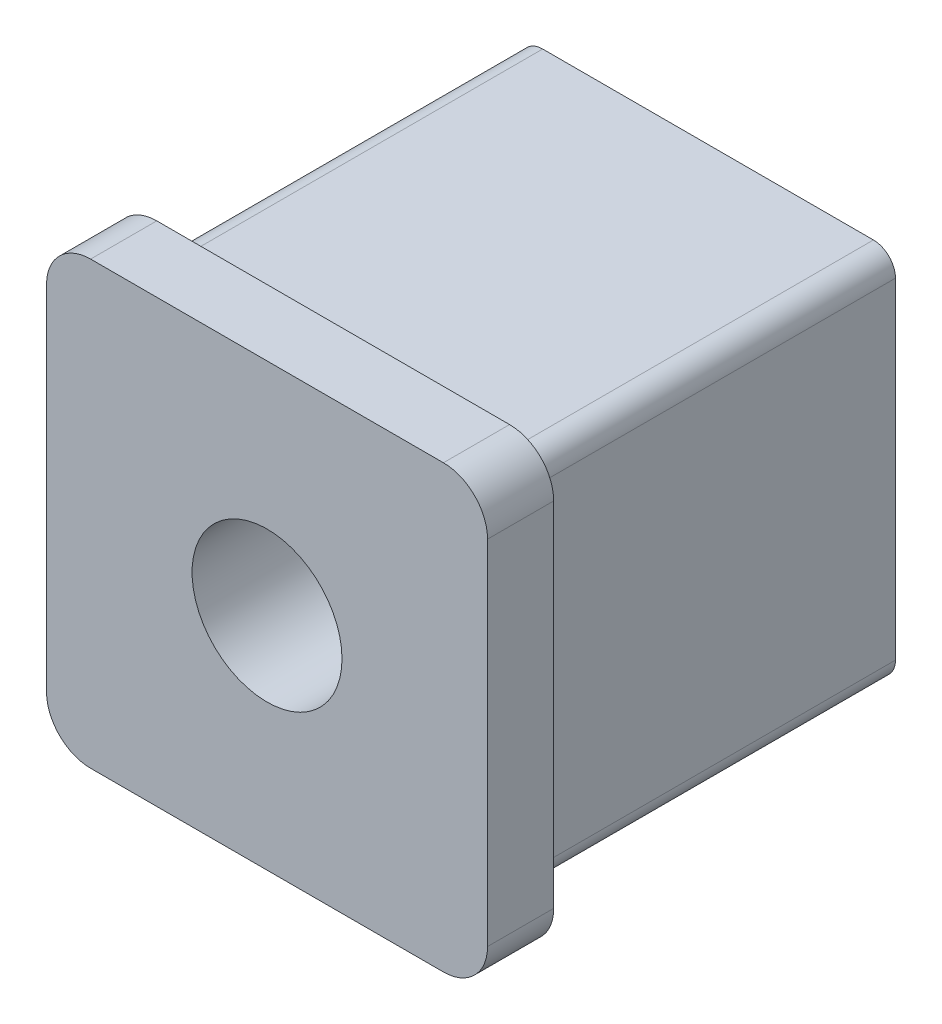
ISO-10303-21;
HEADER;
FILE_DESCRIPTION(('STEP AP214'),'2;1');
FILE_NAME('part.step','',(''),(''),'','','');
FILE_SCHEMA(('AUTOMOTIVE_DESIGN { 1 0 10303 214 1 1 1 1 }'));
ENDSEC;
DATA;
#1=APPLICATION_CONTEXT('core data for automotive mechanical design processes');
#2=APPLICATION_PROTOCOL_DEFINITION('international standard','automotive_design',2000,#1);
#3=PRODUCT_CONTEXT('',#1,'mechanical');
#4=PRODUCT('Part','Part','',(#3));
#5=PRODUCT_RELATED_PRODUCT_CATEGORY('part','',(#4));
#6=PRODUCT_DEFINITION_FORMATION('','',#4);
#7=PRODUCT_DEFINITION_CONTEXT('part definition',#1,'design');
#8=PRODUCT_DEFINITION('design','',#6,#7);
#9=PRODUCT_DEFINITION_SHAPE('','',#8);
#10=(LENGTH_UNIT() NAMED_UNIT(*) SI_UNIT(.MILLI.,.METRE.));
#11=(NAMED_UNIT(*) PLANE_ANGLE_UNIT() SI_UNIT($,.RADIAN.));
#12=(NAMED_UNIT(*) SI_UNIT($,.STERADIAN.) SOLID_ANGLE_UNIT());
#13=UNCERTAINTY_MEASURE_WITH_UNIT(LENGTH_MEASURE(1.E-05),#10,'distance_accuracy_value','');
#14=(GEOMETRIC_REPRESENTATION_CONTEXT(3) GLOBAL_UNCERTAINTY_ASSIGNED_CONTEXT((#13)) GLOBAL_UNIT_ASSIGNED_CONTEXT((#10,
#11,#12)) REPRESENTATION_CONTEXT('',''));
#15=CARTESIAN_POINT('',(0.,0.,0.));
#16=DIRECTION('',(0.,0.,1.));
#17=DIRECTION('',(1.,0.,0.));
#18=AXIS2_PLACEMENT_3D('',#15,#16,#17);
#19=CARTESIAN_POINT('',(-8.00000000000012,8.00000000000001,-2.22044604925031E-12));
#20=DIRECTION('',(0.,0.,0.999999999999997));
#21=DIRECTION('',(0.999999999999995,0.,0.));
#22=AXIS2_PLACEMENT_3D('',#19,#20,#21);
#23=PLANE('',#22);
#24=CARTESIAN_POINT('',(-8.00000000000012,8.00000000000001,-2.22044604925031E-12));
#25=DIRECTION('',(0.,0.,0.999999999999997));
#26=DIRECTION('',(0.999999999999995,0.,0.));
#27=AXIS2_PLACEMENT_3D('',#24,#25,#26);
#28=CIRCLE('',#27,2.);
#29=CARTESIAN_POINT('',(-8.00000000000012,9.99999999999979,-1.99840144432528E-12));
#30=VERTEX_POINT('',#29);
#31=CARTESIAN_POINT('',(-9.9999999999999,8.00000000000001,-1.49880108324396E-12));
#32=VERTEX_POINT('',#31);
#33=EDGE_CURVE('E211',#30,#32,#28,.T.);
#34=ORIENTED_EDGE('',*,*,#33,.F.);
#35=DIRECTION('',(-0.999999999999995,0.,0.));
#36=VECTOR('',#35,1.);
#37=CARTESIAN_POINT('',(7.9999999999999,10.0000000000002,-1.22124532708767E-12));
#38=LINE('',#37,#36);
#39=CARTESIAN_POINT('',(7.9999999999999,10.0000000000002,-1.22124532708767E-12));
#40=VERTEX_POINT('',#39);
#41=EDGE_CURVE('E233',#40,#30,#38,.T.);
#42=ORIENTED_EDGE('',*,*,#41,.F.);
#43=CARTESIAN_POINT('',(7.9999999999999,8.,-1.66533453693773E-12));
#44=DIRECTION('',(0.,0.,0.999999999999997));
#45=DIRECTION('',(0.999999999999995,0.,0.));
#46=AXIS2_PLACEMENT_3D('',#43,#44,#45);
#47=CIRCLE('',#46,2.);
#48=CARTESIAN_POINT('',(9.99999999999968,8.,-2.44249065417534E-12));
#49=VERTEX_POINT('',#48);
#50=EDGE_CURVE('E230',#49,#40,#47,.T.);
#51=ORIENTED_EDGE('',*,*,#50,.F.);
#52=DIRECTION('',(0.,0.999999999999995,0.));
#53=VECTOR('',#52,1.);
#54=CARTESIAN_POINT('',(9.99999999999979,-8.00000000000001,-8.88178419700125E-13));
#55=LINE('',#54,#53);
#56=CARTESIAN_POINT('',(9.99999999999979,-8.00000000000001,-8.88178419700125E-13));
#57=VERTEX_POINT('',#56);
#58=EDGE_CURVE('E227',#57,#49,#55,.T.);
#59=ORIENTED_EDGE('',*,*,#58,.F.);
#60=CARTESIAN_POINT('',(8.00000000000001,-8.00000000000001,-1.11022302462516E-13));
#61=DIRECTION('',(0.,0.,0.999999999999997));
#62=DIRECTION('',(0.999999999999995,0.,0.));
#63=AXIS2_PLACEMENT_3D('',#60,#61,#62);
#64=CIRCLE('',#63,2.);
#65=CARTESIAN_POINT('',(8.00000000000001,-10.0000000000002,-1.66533453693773E-13));
#66=VERTEX_POINT('',#65);
#67=EDGE_CURVE('E224',#66,#57,#64,.T.);
#68=ORIENTED_EDGE('',*,*,#67,.F.);
#69=DIRECTION('',(0.999999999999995,0.,0.));
#70=VECTOR('',#69,1.);
#71=CARTESIAN_POINT('',(8.00000000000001,-10.0000000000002,-1.66533453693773E-13));
#72=LINE('',#71,#70);
#73=CARTESIAN_POINT('',(-8.00000000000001,-10.0000000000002,-9.99200722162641E-13));
#74=VERTEX_POINT('',#73);
#75=EDGE_CURVE('E221',#74,#66,#72,.T.);
#76=ORIENTED_EDGE('',*,*,#75,.F.);
#77=CARTESIAN_POINT('',(-8.00000000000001,-8.00000000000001,-6.66133814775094E-13));
#78=DIRECTION('',(0.,0.,0.999999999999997));
#79=DIRECTION('',(-0.999999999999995,0.,0.));
#80=AXIS2_PLACEMENT_3D('',#77,#78,#79);
#81=CIRCLE('',#80,2.);
#82=CARTESIAN_POINT('',(-9.99999999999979,-8.00000000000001,0.));
#83=VERTEX_POINT('',#82);
#84=EDGE_CURVE('E218',#83,#74,#81,.T.);
#85=ORIENTED_EDGE('',*,*,#84,.F.);
#86=DIRECTION('',(0.,-0.999999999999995,0.));
#87=VECTOR('',#86,1.);
#88=CARTESIAN_POINT('',(-9.99999999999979,-8.00000000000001,0.));
#89=LINE('',#88,#87);
#90=EDGE_CURVE('E215',#32,#83,#89,.T.);
#91=ORIENTED_EDGE('',*,*,#90,.F.);
#92=EDGE_LOOP('',(#34,#42,#51,#59,#68,#76,#85,#91));
#93=FACE_BOUND('',#92,.T.);
#94=CARTESIAN_POINT('',(7.50000000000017,7.50000000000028,-9.99200722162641E-13));
#95=DIRECTION('',(0.,0.,-0.999999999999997));
#96=DIRECTION('',(-0.999999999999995,0.,0.));
#97=AXIS2_PLACEMENT_3D('',#94,#95,#96);
#98=CIRCLE('',#97,1.);
#99=CARTESIAN_POINT('',(7.50000000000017,8.50000000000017,-1.22124532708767E-12));
#100=VERTEX_POINT('',#99);
#101=CARTESIAN_POINT('',(8.49999999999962,7.49999999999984,-2.05391259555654E-12));
#102=VERTEX_POINT('',#101);
#103=EDGE_CURVE('E152',#100,#102,#98,.T.);
#104=ORIENTED_EDGE('',*,*,#103,.F.);
#105=DIRECTION('',(0.999999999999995,0.,0.));
#106=VECTOR('',#105,1.);
#107=CARTESIAN_POINT('',(7.50000000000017,8.50000000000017,-1.22124532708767E-12));
#108=LINE('',#107,#106);
#109=CARTESIAN_POINT('',(-7.5000000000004,8.49999999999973,-2.27595720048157E-12));
#110=VERTEX_POINT('',#109);
#111=EDGE_CURVE('E154',#110,#100,#108,.T.);
#112=ORIENTED_EDGE('',*,*,#111,.F.);
#113=CARTESIAN_POINT('',(-7.5000000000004,7.49999999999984,-1.72084568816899E-12));
#114=DIRECTION('',(0.,0.,-0.999999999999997));
#115=DIRECTION('',(0.999999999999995,0.,0.));
#116=AXIS2_PLACEMENT_3D('',#113,#114,#115);
#117=CIRCLE('',#116,1.);
#118=CARTESIAN_POINT('',(-8.49999999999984,7.49999999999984,-9.43689570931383E-13));
#119=VERTEX_POINT('',#118);
#120=EDGE_CURVE('E173',#119,#110,#117,.T.);
#121=ORIENTED_EDGE('',*,*,#120,.F.);
#122=DIRECTION('',(0.,0.999999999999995,0.));
#123=VECTOR('',#122,1.);
#124=CARTESIAN_POINT('',(-8.49999999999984,7.49999999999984,-9.43689570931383E-13));
#125=LINE('',#124,#123);
#126=CARTESIAN_POINT('',(-8.49999999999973,-7.50000000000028,3.88578058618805E-13));
#127=VERTEX_POINT('',#126);
#128=EDGE_CURVE('E548',#127,#119,#125,.T.);
#129=ORIENTED_EDGE('',*,*,#128,.F.);
#130=CARTESIAN_POINT('',(-7.50000000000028,-7.50000000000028,-6.66133814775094E-13));
#131=DIRECTION('',(0.,0.,-0.999999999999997));
#132=DIRECTION('',(-0.999999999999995,0.,0.));
#133=AXIS2_PLACEMENT_3D('',#130,#131,#132);
#134=CIRCLE('',#133,1.);
#135=CARTESIAN_POINT('',(-7.50000000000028,-8.50000000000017,-9.99200722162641E-13));
#136=VERTEX_POINT('',#135);
#137=EDGE_CURVE('E544',#136,#127,#134,.T.);
#138=ORIENTED_EDGE('',*,*,#137,.F.);
#139=DIRECTION('',(-0.999999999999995,0.,0.));
#140=VECTOR('',#139,1.);
#141=CARTESIAN_POINT('',(7.50000000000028,-8.50000000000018,0.));
#142=LINE('',#141,#140);
#143=CARTESIAN_POINT('',(7.50000000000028,-8.50000000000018,0.));
#144=VERTEX_POINT('',#143);
#145=EDGE_CURVE('E540',#144,#136,#142,.T.);
#146=ORIENTED_EDGE('',*,*,#145,.F.);
#147=CARTESIAN_POINT('',(7.50000000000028,-7.50000000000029,4.9960036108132E-13));
#148=DIRECTION('',(0.,0.,-0.999999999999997));
#149=DIRECTION('',(-0.999999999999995,0.,0.));
#150=AXIS2_PLACEMENT_3D('',#147,#148,#149);
#151=CIRCLE('',#150,1.);
#152=CARTESIAN_POINT('',(8.49999999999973,-7.50000000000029,-4.44089209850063E-13));
#153=VERTEX_POINT('',#152);
#154=EDGE_CURVE('E63',#153,#144,#151,.T.);
#155=ORIENTED_EDGE('',*,*,#154,.F.);
#156=DIRECTION('',(0.,-0.999999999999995,0.));
#157=VECTOR('',#156,1.);
#158=CARTESIAN_POINT('',(8.49999999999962,7.49999999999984,-2.05391259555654E-12));
#159=LINE('',#158,#157);
#160=EDGE_CURVE('E58',#102,#153,#159,.T.);
#161=ORIENTED_EDGE('',*,*,#160,.F.);
#162=EDGE_LOOP('',(#104,#112,#121,#129,#138,#146,#155,#161));
#163=FACE_BOUND('',#162,.T.);
#164=ADVANCED_FACE('F42',(#93,#163),#23,.F.);
#165=CARTESIAN_POINT('',(-8.00000000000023,7.99999999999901,2.99999999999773));
#166=DIRECTION('',(0.,0.,-0.999999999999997));
#167=DIRECTION('',(-0.999999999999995,0.,0.));
#168=AXIS2_PLACEMENT_3D('',#165,#166,#167);
#169=CYLINDRICAL_SURFACE('',#168,2.);
#170=ORIENTED_EDGE('',*,*,#33,.T.);
#171=DIRECTION('',(0.,0.,-0.999999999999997));
#172=VECTOR('',#171,1.);
#173=CARTESIAN_POINT('',(-10.,7.99999999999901,2.9999999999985));
#174=LINE('',#173,#172);
#175=CARTESIAN_POINT('',(-10.,7.99999999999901,2.9999999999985));
#176=VERTEX_POINT('',#175);
#177=EDGE_CURVE('E11',#176,#32,#174,.T.);
#178=ORIENTED_EDGE('',*,*,#177,.F.);
#179=CARTESIAN_POINT('',(-8.00000000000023,7.99999999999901,2.99999999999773));
#180=DIRECTION('',(0.,0.,0.999999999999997));
#181=DIRECTION('',(0.999999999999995,0.,0.));
#182=AXIS2_PLACEMENT_3D('',#179,#180,#181);
#183=CIRCLE('',#182,2.);
#184=CARTESIAN_POINT('',(-8.00000000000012,9.99999999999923,2.99999999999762));
#185=VERTEX_POINT('',#184);
#186=EDGE_CURVE('E236',#185,#176,#183,.T.);
#187=ORIENTED_EDGE('',*,*,#186,.F.);
#188=DIRECTION('',(0.,0.,-0.999999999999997));
#189=VECTOR('',#188,1.);
#190=CARTESIAN_POINT('',(-8.00000000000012,9.99999999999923,2.99999999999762));
#191=LINE('',#190,#189);
#192=EDGE_CURVE('E260',#185,#30,#191,.T.);
#193=ORIENTED_EDGE('',*,*,#192,.T.);
#194=EDGE_LOOP('',(#170,#178,#187,#193));
#195=FACE_BOUND('',#194,.T.);
#196=ADVANCED_FACE('F44',(#195),#169,.T.);
#197=CARTESIAN_POINT('',(-10.,-8.0000000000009,2.99999999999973));
#198=DIRECTION('',(0.999999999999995,0.,0.));
#199=DIRECTION('',(0.,0.999999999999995,0.));
#200=AXIS2_PLACEMENT_3D('',#197,#198,#199);
#201=PLANE('',#200);
#202=ORIENTED_EDGE('',*,*,#90,.T.);
#203=DIRECTION('',(0.,0.,-0.999999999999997));
#204=VECTOR('',#203,1.);
#205=CARTESIAN_POINT('',(-10.,-8.0000000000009,2.99999999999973));
#206=LINE('',#205,#204);
#207=CARTESIAN_POINT('',(-10.,-8.0000000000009,2.99999999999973));
#208=VERTEX_POINT('',#207);
#209=EDGE_CURVE('E51',#208,#83,#206,.T.);
#210=ORIENTED_EDGE('',*,*,#209,.F.);
#211=DIRECTION('',(0.,-0.999999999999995,0.));
#212=VECTOR('',#211,1.);
#213=CARTESIAN_POINT('',(-10.,-8.0000000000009,2.99999999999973));
#214=LINE('',#213,#212);
#215=EDGE_CURVE('E240',#176,#208,#214,.T.);
#216=ORIENTED_EDGE('',*,*,#215,.F.);
#217=ORIENTED_EDGE('',*,*,#177,.T.);
#218=EDGE_LOOP('',(#202,#210,#216,#217));
#219=FACE_BOUND('',#218,.T.);
#220=ADVANCED_FACE('F311',(#219),#201,.F.);
#221=CARTESIAN_POINT('',(-8.00000000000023,-8.0000000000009,2.999999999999));
#222=DIRECTION('',(0.,0.,-0.999999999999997));
#223=DIRECTION('',(-0.999999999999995,0.,0.));
#224=AXIS2_PLACEMENT_3D('',#221,#222,#223);
#225=CYLINDRICAL_SURFACE('',#224,2.);
#226=ORIENTED_EDGE('',*,*,#84,.T.);
#227=DIRECTION('',(0.,0.,-0.999999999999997));
#228=VECTOR('',#227,1.);
#229=CARTESIAN_POINT('',(-8.00000000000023,-10.0000000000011,2.99999999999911));
#230=LINE('',#229,#228);
#231=CARTESIAN_POINT('',(-8.00000000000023,-10.0000000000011,2.99999999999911));
#232=VERTEX_POINT('',#231);
#233=EDGE_CURVE('E280',#232,#74,#230,.T.);
#234=ORIENTED_EDGE('',*,*,#233,.F.);
#235=CARTESIAN_POINT('',(-8.00000000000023,-8.0000000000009,2.999999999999));
#236=DIRECTION('',(0.,0.,0.999999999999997));
#237=DIRECTION('',(-0.999999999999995,0.,0.));
#238=AXIS2_PLACEMENT_3D('',#235,#236,#237);
#239=CIRCLE('',#238,2.);
#240=EDGE_CURVE('E243',#208,#232,#239,.T.);
#241=ORIENTED_EDGE('',*,*,#240,.F.);
#242=ORIENTED_EDGE('',*,*,#209,.T.);
#243=EDGE_LOOP('',(#226,#234,#241,#242));
#244=FACE_BOUND('',#243,.T.);
#245=ADVANCED_FACE('F289',(#244),#225,.T.);
#246=CARTESIAN_POINT('',(7.99999999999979,-10.0000000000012,2.99999999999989));
#247=DIRECTION('',(0.,0.999999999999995,0.));
#248=DIRECTION('',(0.,0.,0.999999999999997));
#249=AXIS2_PLACEMENT_3D('',#246,#247,#248);
#250=PLANE('',#249);
#251=ORIENTED_EDGE('',*,*,#75,.T.);
#252=DIRECTION('',(0.,0.,-0.999999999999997));
#253=VECTOR('',#252,1.);
#254=CARTESIAN_POINT('',(7.99999999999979,-10.0000000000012,2.99999999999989));
#255=LINE('',#254,#253);
#256=CARTESIAN_POINT('',(7.99999999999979,-10.0000000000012,2.99999999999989));
#257=VERTEX_POINT('',#256);
#258=EDGE_CURVE('E276',#257,#66,#255,.T.);
#259=ORIENTED_EDGE('',*,*,#258,.F.);
#260=DIRECTION('',(0.999999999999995,0.,0.));
#261=VECTOR('',#260,1.);
#262=CARTESIAN_POINT('',(7.99999999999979,-10.0000000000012,2.99999999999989));
#263=LINE('',#262,#261);
#264=EDGE_CURVE('E246',#232,#257,#263,.T.);
#265=ORIENTED_EDGE('',*,*,#264,.F.);
#266=ORIENTED_EDGE('',*,*,#233,.T.);
#267=EDGE_LOOP('',(#251,#259,#265,#266));
#268=FACE_BOUND('',#267,.T.);
#269=ADVANCED_FACE('F299',(#268),#250,.F.);
#270=CARTESIAN_POINT('',(7.99999999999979,-8.00000000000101,2.99999999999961));
#271=DIRECTION('',(0.,0.,-0.999999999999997));
#272=DIRECTION('',(-0.999999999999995,0.,0.));
#273=AXIS2_PLACEMENT_3D('',#270,#271,#272);
#274=CYLINDRICAL_SURFACE('',#273,2.);
#275=ORIENTED_EDGE('',*,*,#67,.T.);
#276=DIRECTION('',(0.,0.,-0.999999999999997));
#277=VECTOR('',#276,1.);
#278=CARTESIAN_POINT('',(9.99999999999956,-8.00000000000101,2.99999999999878));
#279=LINE('',#278,#277);
#280=CARTESIAN_POINT('',(9.99999999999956,-8.00000000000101,2.99999999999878));
#281=VERTEX_POINT('',#280);
#282=EDGE_CURVE('E272',#281,#57,#279,.T.);
#283=ORIENTED_EDGE('',*,*,#282,.F.);
#284=CARTESIAN_POINT('',(7.99999999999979,-8.00000000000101,2.99999999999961));
#285=DIRECTION('',(0.,0.,0.999999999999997));
#286=DIRECTION('',(0.999999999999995,0.,0.));
#287=AXIS2_PLACEMENT_3D('',#284,#285,#286);
#288=CIRCLE('',#287,2.);
#289=EDGE_CURVE('E249',#257,#281,#288,.T.);
#290=ORIENTED_EDGE('',*,*,#289,.F.);
#291=ORIENTED_EDGE('',*,*,#258,.T.);
#292=EDGE_LOOP('',(#275,#283,#290,#291));
#293=FACE_BOUND('',#292,.T.);
#294=ADVANCED_FACE('F303',(#293),#274,.T.);
#295=CARTESIAN_POINT('',(9.99999999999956,-8.00000000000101,2.99999999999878));
#296=DIRECTION('',(-0.999999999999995,0.,0.));
#297=DIRECTION('',(0.,0.,0.999999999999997));
#298=AXIS2_PLACEMENT_3D('',#295,#296,#297);
#299=PLANE('',#298);
#300=ORIENTED_EDGE('',*,*,#58,.T.);
#301=DIRECTION('',(0.,0.,-0.999999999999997));
#302=VECTOR('',#301,1.);
#303=CARTESIAN_POINT('',(9.99999999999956,7.999999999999,2.99999999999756));
#304=LINE('',#303,#302);
#305=CARTESIAN_POINT('',(9.99999999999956,7.999999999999,2.99999999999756));
#306=VERTEX_POINT('',#305);
#307=EDGE_CURVE('E268',#306,#49,#304,.T.);
#308=ORIENTED_EDGE('',*,*,#307,.F.);
#309=DIRECTION('',(0.,0.999999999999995,0.));
#310=VECTOR('',#309,1.);
#311=CARTESIAN_POINT('',(9.99999999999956,-8.00000000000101,2.99999999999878));
#312=LINE('',#311,#310);
#313=EDGE_CURVE('E252',#281,#306,#312,.T.);
#314=ORIENTED_EDGE('',*,*,#313,.F.);
#315=ORIENTED_EDGE('',*,*,#282,.T.);
#316=EDGE_LOOP('',(#300,#308,#314,#315));
#317=FACE_BOUND('',#316,.T.);
#318=ADVANCED_FACE('F324',(#317),#299,.F.);
#319=CARTESIAN_POINT('',(7.99999999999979,7.999999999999,2.99999999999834));
#320=DIRECTION('',(0.,0.,-0.999999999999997));
#321=DIRECTION('',(-0.999999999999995,0.,0.));
#322=AXIS2_PLACEMENT_3D('',#319,#320,#321);
#323=CYLINDRICAL_SURFACE('',#322,2.);
#324=ORIENTED_EDGE('',*,*,#50,.T.);
#325=DIRECTION('',(0.,0.,-0.999999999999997));
#326=VECTOR('',#325,1.);
#327=CARTESIAN_POINT('',(7.9999999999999,9.99999999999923,2.99999999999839));
#328=LINE('',#327,#326);
#329=CARTESIAN_POINT('',(7.9999999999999,9.99999999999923,2.99999999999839));
#330=VERTEX_POINT('',#329);
#331=EDGE_CURVE('E264',#330,#40,#328,.T.);
#332=ORIENTED_EDGE('',*,*,#331,.F.);
#333=CARTESIAN_POINT('',(7.99999999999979,7.999999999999,2.99999999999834));
#334=DIRECTION('',(0.,0.,0.999999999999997));
#335=DIRECTION('',(0.999999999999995,0.,0.));
#336=AXIS2_PLACEMENT_3D('',#333,#334,#335);
#337=CIRCLE('',#336,2.);
#338=EDGE_CURVE('E255',#306,#330,#337,.T.);
#339=ORIENTED_EDGE('',*,*,#338,.F.);
#340=ORIENTED_EDGE('',*,*,#307,.T.);
#341=EDGE_LOOP('',(#324,#332,#339,#340));
#342=FACE_BOUND('',#341,.T.);
#343=ADVANCED_FACE('F322',(#342),#323,.T.);
#344=CARTESIAN_POINT('',(7.9999999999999,9.99999999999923,2.99999999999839));
#345=DIRECTION('',(0.,-0.999999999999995,0.));
#346=DIRECTION('',(0.999999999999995,0.,0.));
#347=AXIS2_PLACEMENT_3D('',#344,#345,#346);
#348=PLANE('',#347);
#349=ORIENTED_EDGE('',*,*,#41,.T.);
#350=ORIENTED_EDGE('',*,*,#192,.F.);
#351=DIRECTION('',(-0.999999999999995,0.,0.));
#352=VECTOR('',#351,1.);
#353=CARTESIAN_POINT('',(7.9999999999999,9.99999999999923,2.99999999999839));
#354=LINE('',#353,#352);
#355=EDGE_CURVE('E257',#330,#185,#354,.T.);
#356=ORIENTED_EDGE('',*,*,#355,.F.);
#357=ORIENTED_EDGE('',*,*,#331,.T.);
#358=EDGE_LOOP('',(#349,#350,#356,#357));
#359=FACE_BOUND('',#358,.T.);
#360=ADVANCED_FACE('F317',(#359),#348,.F.);
#361=CARTESIAN_POINT('',(-8.00000000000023,7.99999999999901,2.99999999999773));
#362=DIRECTION('',(0.,0.,0.999999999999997));
#363=DIRECTION('',(0.999999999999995,0.,0.));
#364=AXIS2_PLACEMENT_3D('',#361,#362,#363);
#365=PLANE('',#364);
#366=CARTESIAN_POINT('',(-2.22044604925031E-13,-1.00093544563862E-12,2.99999999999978));
#367=DIRECTION('',(0.,0.,0.999999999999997));
#368=DIRECTION('',(0.999999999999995,0.,0.));
#369=AXIS2_PLACEMENT_3D('',#366,#367,#368);
#370=CIRCLE('',#369,3.4);
#371=CARTESIAN_POINT('',(3.39999999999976,-1.03704678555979E-12,2.99999999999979));
#372=VERTEX_POINT('',#371);
#373=EDGE_CURVE('E527',#372,#372,#370,.T.);
#374=ORIENTED_EDGE('',*,*,#373,.F.);
#375=EDGE_LOOP('',(#374));
#376=FACE_BOUND('',#375,.T.);
#377=ORIENTED_EDGE('',*,*,#186,.T.);
#378=ORIENTED_EDGE('',*,*,#215,.T.);
#379=ORIENTED_EDGE('',*,*,#240,.T.);
#380=ORIENTED_EDGE('',*,*,#264,.T.);
#381=ORIENTED_EDGE('',*,*,#289,.T.);
#382=ORIENTED_EDGE('',*,*,#313,.T.);
#383=ORIENTED_EDGE('',*,*,#338,.T.);
#384=ORIENTED_EDGE('',*,*,#355,.T.);
#385=EDGE_LOOP('',(#377,#378,#379,#380,#381,#382,#383,#384));
#386=FACE_BOUND('',#385,.T.);
#387=ADVANCED_FACE('F307',(#376,#386),#365,.T.);
#388=CARTESIAN_POINT('',(7.50000000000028,7.50000000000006,-16.9999999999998));
#389=DIRECTION('',(0.,0.,0.999999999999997));
#390=DIRECTION('',(0.999999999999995,0.,0.));
#391=AXIS2_PLACEMENT_3D('',#388,#389,#390);
#392=CYLINDRICAL_SURFACE('',#391,1.);
#393=ORIENTED_EDGE('',*,*,#103,.T.);
#394=DIRECTION('',(0.,0.,0.999999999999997));
#395=VECTOR('',#394,1.);
#396=CARTESIAN_POINT('',(8.49999999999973,7.50000000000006,-17.0000000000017));
#397=LINE('',#396,#395);
#398=CARTESIAN_POINT('',(8.49999999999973,7.50000000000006,-17.0000000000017));
#399=VERTEX_POINT('',#398);
#400=EDGE_CURVE('E208',#399,#102,#397,.T.);
#401=ORIENTED_EDGE('',*,*,#400,.F.);
#402=CARTESIAN_POINT('',(7.50000000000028,7.50000000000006,-16.9999999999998));
#403=DIRECTION('',(0.,0.,-0.999999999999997));
#404=DIRECTION('',(-0.999999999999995,0.,0.));
#405=AXIS2_PLACEMENT_3D('',#402,#403,#404);
#406=CIRCLE('',#405,1.);
#407=CARTESIAN_POINT('',(7.50000000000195,8.5000000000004,-17.0000000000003));
#408=VERTEX_POINT('',#407);
#409=EDGE_CURVE('E172',#408,#399,#406,.T.);
#410=ORIENTED_EDGE('',*,*,#409,.F.);
#411=DIRECTION('',(0.,0.,0.999999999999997));
#412=VECTOR('',#411,1.);
#413=CARTESIAN_POINT('',(7.50000000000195,8.5000000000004,-17.0000000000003));
#414=LINE('',#413,#412);
#415=EDGE_CURVE('E167',#408,#100,#414,.T.);
#416=ORIENTED_EDGE('',*,*,#415,.T.);
#417=EDGE_LOOP('',(#393,#401,#410,#416));
#418=FACE_BOUND('',#417,.T.);
#419=ADVANCED_FACE('F175',(#418),#392,.T.);
#420=CARTESIAN_POINT('',(8.49999999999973,7.50000000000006,-17.0000000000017));
#421=DIRECTION('',(-0.999999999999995,0.,0.));
#422=DIRECTION('',(0.,-0.999999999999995,0.));
#423=AXIS2_PLACEMENT_3D('',#420,#421,#422);
#424=PLANE('',#423);
#425=ORIENTED_EDGE('',*,*,#160,.T.);
#426=DIRECTION('',(0.,0.,0.999999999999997));
#427=VECTOR('',#426,1.);
#428=CARTESIAN_POINT('',(8.49999999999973,-7.49999999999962,-16.9999999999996));
#429=LINE('',#428,#427);
#430=CARTESIAN_POINT('',(8.49999999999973,-7.49999999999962,-16.9999999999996));
#431=VERTEX_POINT('',#430);
#432=EDGE_CURVE('E204',#431,#153,#429,.T.);
#433=ORIENTED_EDGE('',*,*,#432,.F.);
#434=DIRECTION('',(0.,-0.999999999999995,0.));
#435=VECTOR('',#434,1.);
#436=CARTESIAN_POINT('',(8.49999999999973,7.50000000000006,-17.0000000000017));
#437=LINE('',#436,#435);
#438=EDGE_CURVE('E556',#399,#431,#437,.T.);
#439=ORIENTED_EDGE('',*,*,#438,.F.);
#440=ORIENTED_EDGE('',*,*,#400,.T.);
#441=EDGE_LOOP('',(#425,#433,#439,#440));
#442=FACE_BOUND('',#441,.T.);
#443=ADVANCED_FACE('F359',(#442),#424,.F.);
#444=CARTESIAN_POINT('',(7.50000000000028,-7.49999999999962,-16.9999999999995));
#445=DIRECTION('',(0.,0.,0.999999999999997));
#446=DIRECTION('',(0.999999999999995,0.,0.));
#447=AXIS2_PLACEMENT_3D('',#444,#445,#446);
#448=CYLINDRICAL_SURFACE('',#447,1.);
#449=ORIENTED_EDGE('',*,*,#154,.T.);
#450=DIRECTION('',(0.,0.,0.999999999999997));
#451=VECTOR('',#450,1.);
#452=CARTESIAN_POINT('',(7.50000000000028,-8.49999999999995,-16.9999999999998));
#453=LINE('',#452,#451);
#454=CARTESIAN_POINT('',(7.50000000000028,-8.49999999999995,-16.9999999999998));
#455=VERTEX_POINT('',#454);
#456=EDGE_CURVE('E201',#455,#144,#453,.T.);
#457=ORIENTED_EDGE('',*,*,#456,.F.);
#458=CARTESIAN_POINT('',(7.50000000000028,-7.49999999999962,-16.9999999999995));
#459=DIRECTION('',(0.,0.,-0.999999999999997));
#460=DIRECTION('',(-0.999999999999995,0.,0.));
#461=AXIS2_PLACEMENT_3D('',#458,#459,#460);
#462=CIRCLE('',#461,1.);
#463=EDGE_CURVE('E559',#431,#455,#462,.T.);
#464=ORIENTED_EDGE('',*,*,#463,.F.);
#465=ORIENTED_EDGE('',*,*,#432,.T.);
#466=EDGE_LOOP('',(#449,#457,#464,#465));
#467=FACE_BOUND('',#466,.T.);
#468=ADVANCED_FACE('F365',(#467),#448,.T.);
#469=CARTESIAN_POINT('',(7.50000000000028,-8.49999999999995,-16.9999999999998));
#470=DIRECTION('',(0.,0.999999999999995,0.));
#471=DIRECTION('',(0.,0.,0.999999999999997));
#472=AXIS2_PLACEMENT_3D('',#469,#470,#471);
#473=PLANE('',#472);
#474=ORIENTED_EDGE('',*,*,#145,.T.);
#475=DIRECTION('',(0.,0.,0.999999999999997));
#476=VECTOR('',#475,1.);
#477=CARTESIAN_POINT('',(-7.49999999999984,-8.49999999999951,-17.0000000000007));
#478=LINE('',#477,#476);
#479=CARTESIAN_POINT('',(-7.49999999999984,-8.49999999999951,-17.0000000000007));
#480=VERTEX_POINT('',#479);
#481=EDGE_CURVE('E197',#480,#136,#478,.T.);
#482=ORIENTED_EDGE('',*,*,#481,.F.);
#483=DIRECTION('',(-0.999999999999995,0.,0.));
#484=VECTOR('',#483,1.);
#485=CARTESIAN_POINT('',(7.50000000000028,-8.49999999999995,-16.9999999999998));
#486=LINE('',#485,#484);
#487=EDGE_CURVE('E562',#455,#480,#486,.T.);
#488=ORIENTED_EDGE('',*,*,#487,.F.);
#489=ORIENTED_EDGE('',*,*,#456,.T.);
#490=EDGE_LOOP('',(#474,#482,#488,#489));
#491=FACE_BOUND('',#490,.T.);
#492=ADVANCED_FACE('F372',(#491),#473,.F.);
#493=CARTESIAN_POINT('',(-7.50000000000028,-7.49999999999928,-17.0000000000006));
#494=DIRECTION('',(0.,0.,0.999999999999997));
#495=DIRECTION('',(0.999999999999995,0.,0.));
#496=AXIS2_PLACEMENT_3D('',#493,#494,#495);
#497=CYLINDRICAL_SURFACE('',#496,1.);
#498=ORIENTED_EDGE('',*,*,#137,.T.);
#499=DIRECTION('',(0.,0.,0.999999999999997));
#500=VECTOR('',#499,1.);
#501=CARTESIAN_POINT('',(-8.49999999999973,-7.49999999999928,-16.9999999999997));
#502=LINE('',#501,#500);
#503=CARTESIAN_POINT('',(-8.49999999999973,-7.49999999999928,-16.9999999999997));
#504=VERTEX_POINT('',#503);
#505=EDGE_CURVE('E193',#504,#127,#502,.T.);
#506=ORIENTED_EDGE('',*,*,#505,.F.);
#507=CARTESIAN_POINT('',(-7.50000000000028,-7.49999999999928,-17.0000000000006));
#508=DIRECTION('',(0.,0.,-0.999999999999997));
#509=DIRECTION('',(-0.999999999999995,0.,0.));
#510=AXIS2_PLACEMENT_3D('',#507,#508,#509);
#511=CIRCLE('',#510,1.);
#512=EDGE_CURVE('E564',#480,#504,#511,.T.);
#513=ORIENTED_EDGE('',*,*,#512,.F.);
#514=ORIENTED_EDGE('',*,*,#481,.T.);
#515=EDGE_LOOP('',(#498,#506,#513,#514));
#516=FACE_BOUND('',#515,.T.);
#517=ADVANCED_FACE('F380',(#516),#497,.T.);
#518=CARTESIAN_POINT('',(-8.49999999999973,7.50000000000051,-17.));
#519=DIRECTION('',(0.999999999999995,0.,0.));
#520=DIRECTION('',(0.,0.999999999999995,0.));
#521=AXIS2_PLACEMENT_3D('',#518,#519,#520);
#522=PLANE('',#521);
#523=ORIENTED_EDGE('',*,*,#128,.T.);
#524=DIRECTION('',(0.,0.,0.999999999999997));
#525=VECTOR('',#524,1.);
#526=CARTESIAN_POINT('',(-8.49999999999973,7.50000000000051,-17.));
#527=LINE('',#526,#525);
#528=CARTESIAN_POINT('',(-8.49999999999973,7.50000000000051,-17.));
#529=VERTEX_POINT('',#528);
#530=EDGE_CURVE('E183',#529,#119,#527,.T.);
#531=ORIENTED_EDGE('',*,*,#530,.F.);
#532=DIRECTION('',(0.,0.999999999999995,0.));
#533=VECTOR('',#532,1.);
#534=CARTESIAN_POINT('',(-8.49999999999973,7.50000000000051,-17.));
#535=LINE('',#534,#533);
#536=EDGE_CURVE('E567',#504,#529,#535,.T.);
#537=ORIENTED_EDGE('',*,*,#536,.F.);
#538=ORIENTED_EDGE('',*,*,#505,.T.);
#539=EDGE_LOOP('',(#523,#531,#537,#538));
#540=FACE_BOUND('',#539,.T.);
#541=ADVANCED_FACE('F388',(#540),#522,.F.);
#542=CARTESIAN_POINT('',(-7.50000000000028,7.50000000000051,-17.0000000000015));
#543=DIRECTION('',(0.,0.,0.999999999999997));
#544=DIRECTION('',(0.999999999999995,0.,0.));
#545=AXIS2_PLACEMENT_3D('',#542,#543,#544);
#546=CYLINDRICAL_SURFACE('',#545,1.);
#547=ORIENTED_EDGE('',*,*,#120,.T.);
#548=DIRECTION('',(0.,0.,0.999999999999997));
#549=VECTOR('',#548,1.);
#550=CARTESIAN_POINT('',(-7.49999999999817,8.50000000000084,-17.0000000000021));
#551=LINE('',#550,#549);
#552=CARTESIAN_POINT('',(-7.49999999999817,8.50000000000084,-17.0000000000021));
#553=VERTEX_POINT('',#552);
#554=EDGE_CURVE('E170',#553,#110,#551,.T.);
#555=ORIENTED_EDGE('',*,*,#554,.F.);
#556=CARTESIAN_POINT('',(-7.50000000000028,7.50000000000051,-17.0000000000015));
#557=DIRECTION('',(0.,0.,-0.999999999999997));
#558=DIRECTION('',(0.999999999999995,0.,0.));
#559=AXIS2_PLACEMENT_3D('',#556,#557,#558);
#560=CIRCLE('',#559,1.);
#561=EDGE_CURVE('E186',#529,#553,#560,.T.);
#562=ORIENTED_EDGE('',*,*,#561,.F.);
#563=ORIENTED_EDGE('',*,*,#530,.T.);
#564=EDGE_LOOP('',(#547,#555,#562,#563));
#565=FACE_BOUND('',#564,.T.);
#566=ADVANCED_FACE('F396',(#565),#546,.T.);
#567=CARTESIAN_POINT('',(7.50000000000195,8.5000000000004,-17.0000000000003));
#568=DIRECTION('',(0.,-0.999999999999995,0.));
#569=DIRECTION('',(0.,0.,-0.999999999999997));
#570=AXIS2_PLACEMENT_3D('',#567,#568,#569);
#571=PLANE('',#570);
#572=ORIENTED_EDGE('',*,*,#111,.T.);
#573=ORIENTED_EDGE('',*,*,#415,.F.);
#574=DIRECTION('',(0.999999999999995,0.,0.));
#575=VECTOR('',#574,1.);
#576=CARTESIAN_POINT('',(7.50000000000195,8.5000000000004,-17.0000000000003));
#577=LINE('',#576,#575);
#578=EDGE_CURVE('E178',#553,#408,#577,.T.);
#579=ORIENTED_EDGE('',*,*,#578,.F.);
#580=ORIENTED_EDGE('',*,*,#554,.T.);
#581=EDGE_LOOP('',(#572,#573,#579,#580));
#582=FACE_BOUND('',#581,.T.);
#583=ADVANCED_FACE('F165',(#582),#571,.F.);
#584=CARTESIAN_POINT('',(7.50000000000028,7.50000000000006,-16.9999999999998));
#585=DIRECTION('',(0.,0.,-0.999999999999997));
#586=DIRECTION('',(-0.999999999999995,0.,0.));
#587=AXIS2_PLACEMENT_3D('',#584,#585,#586);
#588=PLANE('',#587);
#589=CARTESIAN_POINT('',(0.,1.12757025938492E-13,-17.0000000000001));
#590=DIRECTION('',(0.,0.,-0.999999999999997));
#591=DIRECTION('',(-0.999999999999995,0.,0.));
#592=AXIS2_PLACEMENT_3D('',#589,#590,#591);
#593=CIRCLE('',#592,3.4);
#594=CARTESIAN_POINT('',(3.39999999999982,-9.78925596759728E-13,-17.0000000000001));
#595=VERTEX_POINT('',#594);
#596=EDGE_CURVE('E160',#595,#595,#593,.T.);
#597=ORIENTED_EDGE('',*,*,#596,.F.);
#598=EDGE_LOOP('',(#597));
#599=FACE_BOUND('',#598,.T.);
#600=ORIENTED_EDGE('',*,*,#409,.T.);
#601=ORIENTED_EDGE('',*,*,#438,.T.);
#602=ORIENTED_EDGE('',*,*,#463,.T.);
#603=ORIENTED_EDGE('',*,*,#487,.T.);
#604=ORIENTED_EDGE('',*,*,#512,.T.);
#605=ORIENTED_EDGE('',*,*,#536,.T.);
#606=ORIENTED_EDGE('',*,*,#561,.T.);
#607=ORIENTED_EDGE('',*,*,#578,.T.);
#608=EDGE_LOOP('',(#600,#601,#602,#603,#604,#605,#606,#607));
#609=FACE_BOUND('',#608,.T.);
#610=ADVANCED_FACE('F411',(#599,#609),#588,.T.);
#611=CARTESIAN_POINT('',(-2.22044604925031E-13,-1.00093544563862E-12,2.99999999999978));
#612=DIRECTION('',(0.,0.,0.999999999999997));
#613=DIRECTION('',(0.999999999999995,0.,0.));
#614=AXIS2_PLACEMENT_3D('',#611,#612,#613);
#615=CYLINDRICAL_SURFACE('',#614,3.4);
#616=CARTESIAN_POINT('',(3.39999999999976,-1.03704678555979E-12,2.99999999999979));
#617=CARTESIAN_POINT('',(3.39999999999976,-1.03644135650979E-12,2.79166666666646));
#618=CARTESIAN_POINT('',(3.39999999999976,-1.03583592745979E-12,2.58333333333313));
#619=CARTESIAN_POINT('',(3.39999999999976,-1.03462506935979E-12,2.16666666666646));
#620=CARTESIAN_POINT('',(3.39999999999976,-1.03401964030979E-12,1.95833333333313));
#621=CARTESIAN_POINT('',(3.39999999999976,-1.03280878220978E-12,1.54166666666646));
#622=CARTESIAN_POINT('',(3.39999999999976,-1.03220335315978E-12,1.33333333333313));
#623=CARTESIAN_POINT('',(3.39999999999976,-1.03099249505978E-12,0.916666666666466));
#624=CARTESIAN_POINT('',(3.39999999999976,-1.03038706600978E-12,0.708333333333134));
#625=CARTESIAN_POINT('',(3.39999999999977,-1.02917620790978E-12,0.291666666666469));
#626=CARTESIAN_POINT('',(3.39999999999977,-1.02857077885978E-12,0.0833333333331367));
#627=CARTESIAN_POINT('',(3.39999999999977,-1.02735992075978E-12,-0.333333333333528));
#628=CARTESIAN_POINT('',(3.39999999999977,-1.02675449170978E-12,-0.54166666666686));
#629=CARTESIAN_POINT('',(3.39999999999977,-1.02554363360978E-12,-0.958333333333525));
#630=CARTESIAN_POINT('',(3.39999999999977,-1.02493820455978E-12,-1.16666666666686));
#631=CARTESIAN_POINT('',(3.39999999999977,-1.02372734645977E-12,-1.58333333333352));
#632=CARTESIAN_POINT('',(3.39999999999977,-1.02312191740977E-12,-1.79166666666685));
#633=CARTESIAN_POINT('',(3.39999999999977,-1.02191105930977E-12,-2.20833333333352));
#634=CARTESIAN_POINT('',(3.39999999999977,-1.02130563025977E-12,-2.41666666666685));
#635=CARTESIAN_POINT('',(3.39999999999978,-1.02009477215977E-12,-2.83333333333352));
#636=CARTESIAN_POINT('',(3.39999999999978,-1.01948934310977E-12,-3.04166666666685));
#637=CARTESIAN_POINT('',(3.39999999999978,-1.01827848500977E-12,-3.45833333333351));
#638=CARTESIAN_POINT('',(3.39999999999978,-1.01767305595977E-12,-3.66666666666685));
#639=CARTESIAN_POINT('',(3.39999999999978,-1.01646219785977E-12,-4.08333333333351));
#640=CARTESIAN_POINT('',(3.39999999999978,-1.01585676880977E-12,-4.29166666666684));
#641=CARTESIAN_POINT('',(3.39999999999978,-1.01464591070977E-12,-4.70833333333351));
#642=CARTESIAN_POINT('',(3.39999999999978,-1.01404048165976E-12,-4.91666666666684));
#643=CARTESIAN_POINT('',(3.39999999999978,-1.01282962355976E-12,-5.33333333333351));
#644=CARTESIAN_POINT('',(3.39999999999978,-1.01222419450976E-12,-5.54166666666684));
#645=CARTESIAN_POINT('',(3.39999999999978,-1.01101333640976E-12,-5.9583333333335));
#646=CARTESIAN_POINT('',(3.39999999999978,-1.01040790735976E-12,-6.16666666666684));
#647=CARTESIAN_POINT('',(3.39999999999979,-1.00919704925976E-12,-6.5833333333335));
#648=CARTESIAN_POINT('',(3.39999999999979,-1.00859162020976E-12,-6.79166666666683));
#649=CARTESIAN_POINT('',(3.39999999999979,-1.00738076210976E-12,-7.2083333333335));
#650=CARTESIAN_POINT('',(3.39999999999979,-1.00677533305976E-12,-7.41666666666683));
#651=CARTESIAN_POINT('',(3.39999999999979,-1.00556447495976E-12,-7.8333333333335));
#652=CARTESIAN_POINT('',(3.39999999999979,-1.00495904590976E-12,-8.04166666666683));
#653=CARTESIAN_POINT('',(3.39999999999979,-1.00374818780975E-12,-8.45833333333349));
#654=CARTESIAN_POINT('',(3.39999999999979,-1.00314275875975E-12,-8.66666666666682));
#655=CARTESIAN_POINT('',(3.39999999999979,-1.00193190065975E-12,-9.08333333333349));
#656=CARTESIAN_POINT('',(3.39999999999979,-1.00132647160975E-12,-9.29166666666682));
#657=CARTESIAN_POINT('',(3.3999999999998,-1.00011561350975E-12,-9.70833333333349));
#658=CARTESIAN_POINT('',(3.3999999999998,-9.9951018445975E-13,-9.91666666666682));
#659=CARTESIAN_POINT('',(3.3999999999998,-9.98299326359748E-13,-10.3333333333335));
#660=CARTESIAN_POINT('',(3.3999999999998,-9.97693897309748E-13,-10.5416666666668));
#661=CARTESIAN_POINT('',(3.3999999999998,-9.96483039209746E-13,-10.9583333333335));
#662=CARTESIAN_POINT('',(3.3999999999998,-9.95877610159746E-13,-11.1666666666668));
#663=CARTESIAN_POINT('',(3.3999999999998,-9.94666752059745E-13,-11.5833333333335));
#664=CARTESIAN_POINT('',(3.3999999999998,-9.94061323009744E-13,-11.7916666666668));
#665=CARTESIAN_POINT('',(3.3999999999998,-9.92850464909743E-13,-12.2083333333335));
#666=CARTESIAN_POINT('',(3.3999999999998,-9.92245035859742E-13,-12.4166666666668));
#667=CARTESIAN_POINT('',(3.3999999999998,-9.91034177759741E-13,-12.8333333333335));
#668=CARTESIAN_POINT('',(3.3999999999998,-9.9042874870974E-13,-13.0416666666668));
#669=CARTESIAN_POINT('',(3.39999999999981,-9.89217890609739E-13,-13.4583333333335));
#670=CARTESIAN_POINT('',(3.39999999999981,-9.88612461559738E-13,-13.6666666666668));
#671=CARTESIAN_POINT('',(3.39999999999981,-9.87401603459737E-13,-14.0833333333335));
#672=CARTESIAN_POINT('',(3.39999999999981,-9.86796174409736E-13,-14.2916666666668));
#673=CARTESIAN_POINT('',(3.39999999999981,-9.85585316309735E-13,-14.7083333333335));
#674=CARTESIAN_POINT('',(3.39999999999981,-9.84979887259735E-13,-14.9166666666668));
#675=CARTESIAN_POINT('',(3.39999999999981,-9.83769029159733E-13,-15.3333333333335));
#676=CARTESIAN_POINT('',(3.39999999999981,-9.83163600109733E-13,-15.5416666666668));
#677=CARTESIAN_POINT('',(3.39999999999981,-9.81952742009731E-13,-15.9583333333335));
#678=CARTESIAN_POINT('',(3.39999999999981,-9.81347312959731E-13,-16.1666666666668));
#679=CARTESIAN_POINT('',(3.39999999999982,-9.80136454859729E-13,-16.5833333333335));
#680=CARTESIAN_POINT('',(3.39999999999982,-9.79531025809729E-13,-16.7916666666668));
#681=CARTESIAN_POINT('',(3.39999999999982,-9.78925596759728E-13,-17.0000000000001));
#682=B_SPLINE_CURVE_WITH_KNOTS('',3,(#616,#617,#618,#619,#620,#621,#622,#623,#624,#625,#626,
#627,#628,#629,#630,#631,#632,#633,#634,#635,#636,#637,#638,#639,#640,#641,#642,#643,#644,#645,
#646,#647,#648,#649,#650,#651,#652,#653,#654,#655,#656,#657,#658,#659,#660,#661,#662,#663,#664,
#665,#666,#667,#668,#669,#670,#671,#672,#673,#674,#675,#676,#677,#678,#679,#680,#681),
.UNSPECIFIED.,.F.,.F.,(4,2,2,2,2,2,2,2,2,2,2,2,2,2,2,2,2,2,2,2,2,2,2,2,2,2,2,2,2,2,2,2,4),(0.,
0.624999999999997,1.24999999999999,1.87499999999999,2.49999999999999,3.12499999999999,
3.74999999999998,4.37499999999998,4.99999999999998,5.62499999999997,6.24999999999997,
6.87499999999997,7.49999999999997,8.12499999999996,8.74999999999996,9.37499999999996,
9.99999999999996,10.625,11.2499999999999,11.8749999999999,12.4999999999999,13.1249999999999,
13.7499999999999,14.3749999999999,14.9999999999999,15.6249999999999,16.2499999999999,
16.8749999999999,17.4999999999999,18.1249999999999,18.7499999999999,19.3749999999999,
19.9999999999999),.UNSPECIFIED.);
#683=EDGE_CURVE('BSEAM418',#372,#595,#682,.T.);
#684=ORIENTED_EDGE('',*,*,#373,.T.);
#685=ORIENTED_EDGE('',*,*,#596,.T.);
#686=ORIENTED_EDGE('',*,*,#683,.T.);
#687=ORIENTED_EDGE('',*,*,#683,.F.);
#688=EDGE_LOOP('',(#684,#686,#685,#687));
#689=FACE_BOUND('',#688,.T.);
#690=ADVANCED_FACE('F418',(#689),#615,.F.);
#691=CLOSED_SHELL('',(#164,#196,#220,#245,#269,#294,#318,#343,#360,#387,#419,#443,#468,#492,
#517,#541,#566,#583,#610,#690));
#692=MANIFOLD_SOLID_BREP('B2',#691);
#693=ADVANCED_BREP_SHAPE_REPRESENTATION('',(#18,#692),#14);
#694=SHAPE_DEFINITION_REPRESENTATION(#9,#693);
ENDSEC;
END-ISO-10303-21;
